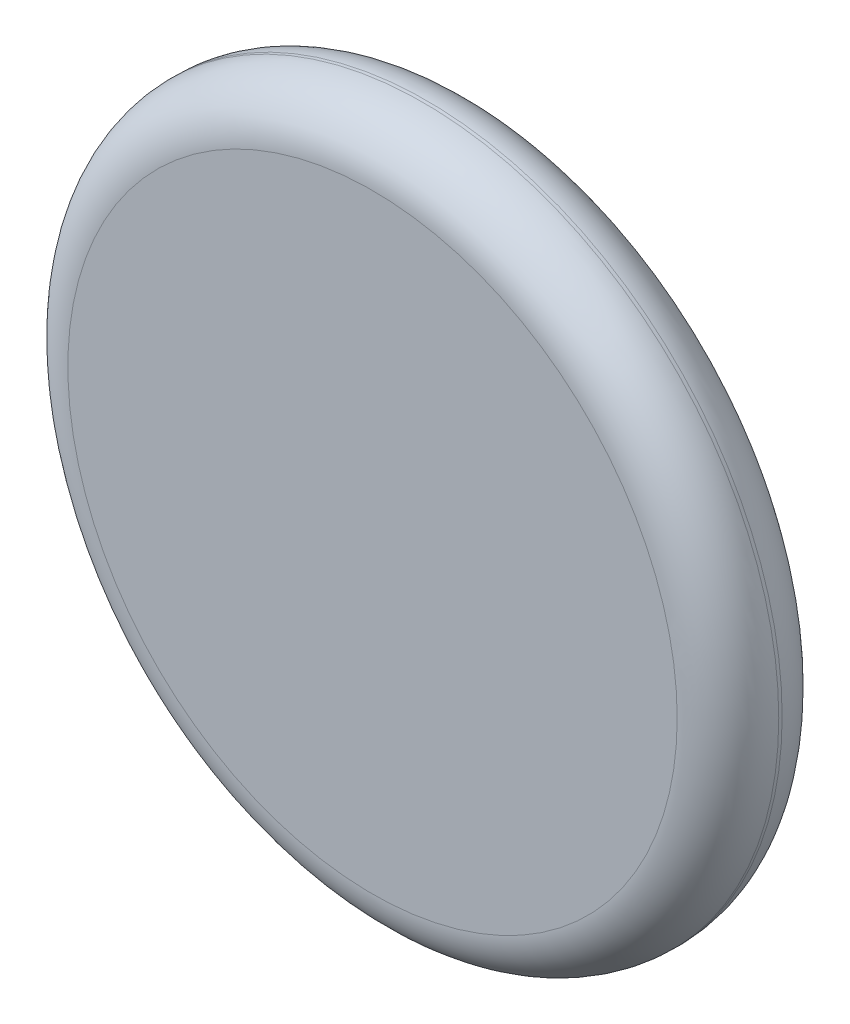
ISO-10303-21;
HEADER;
FILE_DESCRIPTION(('STEP AP214'),'2;1');
FILE_NAME('part.step','',(''),(''),'','','');
FILE_SCHEMA(('AUTOMOTIVE_DESIGN { 1 0 10303 214 1 1 1 1 }'));
ENDSEC;
DATA;
#1=APPLICATION_CONTEXT('core data for automotive mechanical design processes');
#2=APPLICATION_PROTOCOL_DEFINITION('international standard','automotive_design',2000,#1);
#3=PRODUCT_CONTEXT('',#1,'mechanical');
#4=PRODUCT('Part','Part','',(#3));
#5=PRODUCT_RELATED_PRODUCT_CATEGORY('part','',(#4));
#6=PRODUCT_DEFINITION_FORMATION('','',#4);
#7=PRODUCT_DEFINITION_CONTEXT('part definition',#1,'design');
#8=PRODUCT_DEFINITION('design','',#6,#7);
#9=PRODUCT_DEFINITION_SHAPE('','',#8);
#10=(LENGTH_UNIT() NAMED_UNIT(*) SI_UNIT(.MILLI.,.METRE.));
#11=(NAMED_UNIT(*) PLANE_ANGLE_UNIT() SI_UNIT($,.RADIAN.));
#12=(NAMED_UNIT(*) SI_UNIT($,.STERADIAN.) SOLID_ANGLE_UNIT());
#13=UNCERTAINTY_MEASURE_WITH_UNIT(LENGTH_MEASURE(1.E-05),#10,'distance_accuracy_value','');
#14=(GEOMETRIC_REPRESENTATION_CONTEXT(3) GLOBAL_UNCERTAINTY_ASSIGNED_CONTEXT((#13)) GLOBAL_UNIT_ASSIGNED_CONTEXT((#10,
#11,#12)) REPRESENTATION_CONTEXT('',''));
#15=CARTESIAN_POINT('',(0.,0.,0.));
#16=DIRECTION('',(0.,0.,1.));
#17=DIRECTION('',(1.,0.,0.));
#18=AXIS2_PLACEMENT_3D('',#15,#16,#17);
#19=CARTESIAN_POINT('',(0.,0.,6.2));
#20=DIRECTION('',(0.,0.,-1.));
#21=DIRECTION('',(-1.,0.,0.));
#22=AXIS2_PLACEMENT_3D('',#19,#20,#21);
#23=CYLINDRICAL_SURFACE('',#22,21.);
#24=CARTESIAN_POINT('',(0.,0.,3.));
#25=DIRECTION('',(0.,0.,1.));
#26=DIRECTION('',(1.,0.,0.));
#27=AXIS2_PLACEMENT_3D('',#24,#25,#26);
#28=CIRCLE('',#27,21.);
#29=CARTESIAN_POINT('',(-21.,0.,3.));
#30=VERTEX_POINT('',#29);
#31=EDGE_CURVE('E50',#30,#30,#28,.T.);
#32=CARTESIAN_POINT('',(0.,0.,3.2));
#33=DIRECTION('',(0.,0.,1.));
#34=DIRECTION('',(1.,0.,0.));
#35=AXIS2_PLACEMENT_3D('',#32,#33,#34);
#36=CIRCLE('',#35,21.);
#37=CARTESIAN_POINT('',(-21.,0.,3.2));
#38=VERTEX_POINT('',#37);
#39=EDGE_CURVE('E55',#38,#38,#36,.F.);
#40=CARTESIAN_POINT('',(-21.,0.,3.));
#41=CARTESIAN_POINT('',(-21.,0.,3.00208333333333));
#42=CARTESIAN_POINT('',(-21.,0.,3.00416666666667));
#43=CARTESIAN_POINT('',(-21.,0.,3.00833333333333));
#44=CARTESIAN_POINT('',(-21.,0.,3.01041666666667));
#45=CARTESIAN_POINT('',(-21.,0.,3.01458333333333));
#46=CARTESIAN_POINT('',(-21.,0.,3.01666666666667));
#47=CARTESIAN_POINT('',(-21.,0.,3.02083333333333));
#48=CARTESIAN_POINT('',(-21.,0.,3.02291666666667));
#49=CARTESIAN_POINT('',(-21.,0.,3.02708333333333));
#50=CARTESIAN_POINT('',(-21.,0.,3.02916666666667));
#51=CARTESIAN_POINT('',(-21.,0.,3.03333333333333));
#52=CARTESIAN_POINT('',(-21.,0.,3.03541666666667));
#53=CARTESIAN_POINT('',(-21.,0.,3.03958333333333));
#54=CARTESIAN_POINT('',(-21.,0.,3.04166666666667));
#55=CARTESIAN_POINT('',(-21.,0.,3.04583333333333));
#56=CARTESIAN_POINT('',(-21.,0.,3.04791666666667));
#57=CARTESIAN_POINT('',(-21.,0.,3.05208333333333));
#58=CARTESIAN_POINT('',(-21.,0.,3.05416666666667));
#59=CARTESIAN_POINT('',(-21.,0.,3.05833333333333));
#60=CARTESIAN_POINT('',(-21.,0.,3.06041666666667));
#61=CARTESIAN_POINT('',(-21.,0.,3.06458333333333));
#62=CARTESIAN_POINT('',(-21.,0.,3.06666666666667));
#63=CARTESIAN_POINT('',(-21.,0.,3.07083333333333));
#64=CARTESIAN_POINT('',(-21.,0.,3.07291666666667));
#65=CARTESIAN_POINT('',(-21.,0.,3.07708333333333));
#66=CARTESIAN_POINT('',(-21.,0.,3.07916666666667));
#67=CARTESIAN_POINT('',(-21.,0.,3.08333333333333));
#68=CARTESIAN_POINT('',(-21.,0.,3.08541666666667));
#69=CARTESIAN_POINT('',(-21.,0.,3.08958333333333));
#70=CARTESIAN_POINT('',(-21.,0.,3.09166666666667));
#71=CARTESIAN_POINT('',(-21.,0.,3.09583333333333));
#72=CARTESIAN_POINT('',(-21.,0.,3.09791666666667));
#73=CARTESIAN_POINT('',(-21.,0.,3.10208333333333));
#74=CARTESIAN_POINT('',(-21.,0.,3.10416666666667));
#75=CARTESIAN_POINT('',(-21.,0.,3.10833333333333));
#76=CARTESIAN_POINT('',(-21.,0.,3.11041666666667));
#77=CARTESIAN_POINT('',(-21.,0.,3.11458333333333));
#78=CARTESIAN_POINT('',(-21.,0.,3.11666666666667));
#79=CARTESIAN_POINT('',(-21.,0.,3.12083333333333));
#80=CARTESIAN_POINT('',(-21.,0.,3.12291666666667));
#81=CARTESIAN_POINT('',(-21.,0.,3.12708333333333));
#82=CARTESIAN_POINT('',(-21.,0.,3.12916666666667));
#83=CARTESIAN_POINT('',(-21.,0.,3.13333333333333));
#84=CARTESIAN_POINT('',(-21.,0.,3.13541666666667));
#85=CARTESIAN_POINT('',(-21.,0.,3.13958333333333));
#86=CARTESIAN_POINT('',(-21.,0.,3.14166666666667));
#87=CARTESIAN_POINT('',(-21.,0.,3.14583333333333));
#88=CARTESIAN_POINT('',(-21.,0.,3.14791666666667));
#89=CARTESIAN_POINT('',(-21.,0.,3.15208333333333));
#90=CARTESIAN_POINT('',(-21.,0.,3.15416666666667));
#91=CARTESIAN_POINT('',(-21.,0.,3.15833333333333));
#92=CARTESIAN_POINT('',(-21.,0.,3.16041666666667));
#93=CARTESIAN_POINT('',(-21.,0.,3.16458333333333));
#94=CARTESIAN_POINT('',(-21.,0.,3.16666666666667));
#95=CARTESIAN_POINT('',(-21.,0.,3.17083333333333));
#96=CARTESIAN_POINT('',(-21.,0.,3.17291666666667));
#97=CARTESIAN_POINT('',(-21.,0.,3.17708333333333));
#98=CARTESIAN_POINT('',(-21.,0.,3.17916666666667));
#99=CARTESIAN_POINT('',(-21.,0.,3.18333333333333));
#100=CARTESIAN_POINT('',(-21.,0.,3.18541666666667));
#101=CARTESIAN_POINT('',(-21.,0.,3.18958333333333));
#102=CARTESIAN_POINT('',(-21.,0.,3.19166666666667));
#103=CARTESIAN_POINT('',(-21.,0.,3.19583333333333));
#104=CARTESIAN_POINT('',(-21.,0.,3.19791666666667));
#105=CARTESIAN_POINT('',(-21.,0.,3.2));
#106=B_SPLINE_CURVE_WITH_KNOTS('',3,(#40,#41,#42,#43,#44,#45,#46,#47,#48,#49,#50,#51,#52,#53,
#54,#55,#56,#57,#58,#59,#60,#61,#62,#63,#64,#65,#66,#67,#68,#69,#70,#71,#72,#73,#74,#75,#76,#77,
#78,#79,#80,#81,#82,#83,#84,#85,#86,#87,#88,#89,#90,#91,#92,#93,#94,#95,#96,#97,#98,#99,#100,
#101,#102,#103,#104,#105),.UNSPECIFIED.,.F.,.F.,(4,2,2,2,2,2,2,2,2,2,2,2,2,2,2,2,2,2,2,2,2,2,2,
2,2,2,2,2,2,2,2,2,4),(0.,0.00625000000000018,0.0124999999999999,0.0187500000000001,
0.0249999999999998,0.03125,0.0374999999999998,0.04375,0.0499999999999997,0.0562499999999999,
0.0625000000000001,0.0687499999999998,0.075,0.0812499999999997,0.0874999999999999,
0.0937499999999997,0.0999999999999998,0.10625,0.1125,0.11875,0.125,0.13125,0.1375,0.14375,0.15,
0.15625,0.1625,0.16875,0.175,0.18125,0.1875,0.193749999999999,0.2),.UNSPECIFIED.);
#107=EDGE_CURVE('BSEAM37',#30,#38,#106,.T.);
#108=ORIENTED_EDGE('',*,*,#31,.T.);
#109=ORIENTED_EDGE('',*,*,#39,.T.);
#110=ORIENTED_EDGE('',*,*,#107,.T.);
#111=ORIENTED_EDGE('',*,*,#107,.F.);
#112=EDGE_LOOP('',(#108,#110,#109,#111));
#113=FACE_BOUND('',#112,.T.);
#114=ADVANCED_FACE('F37',(#113),#23,.T.);
#115=CARTESIAN_POINT('',(0.,0.,6.2));
#116=DIRECTION('',(0.,0.,1.));
#117=DIRECTION('',(1.,0.,0.));
#118=AXIS2_PLACEMENT_3D('',#115,#116,#117);
#119=PLANE('',#118);
#120=CARTESIAN_POINT('',(0.,0.,6.2));
#121=DIRECTION('',(0.,0.,1.));
#122=DIRECTION('',(1.,0.,0.));
#123=AXIS2_PLACEMENT_3D('',#120,#121,#122);
#124=CIRCLE('',#123,18.);
#125=CARTESIAN_POINT('',(18.,0.,6.2));
#126=VERTEX_POINT('',#125);
#127=EDGE_CURVE('E10',#126,#126,#124,.T.);
#128=ORIENTED_EDGE('',*,*,#127,.T.);
#129=EDGE_LOOP('',(#128));
#130=FACE_BOUND('',#129,.T.);
#131=ADVANCED_FACE('F81',(#130),#119,.T.);
#132=CARTESIAN_POINT('',(0.,0.,0.));
#133=DIRECTION('',(0.,0.,1.));
#134=DIRECTION('',(1.,0.,0.));
#135=AXIS2_PLACEMENT_3D('',#132,#133,#134);
#136=PLANE('',#135);
#137=CARTESIAN_POINT('',(0.,0.,0.));
#138=DIRECTION('',(0.,0.,-1.));
#139=DIRECTION('',(-1.,0.,0.));
#140=AXIS2_PLACEMENT_3D('',#137,#138,#139);
#141=CIRCLE('',#140,1.);
#142=CARTESIAN_POINT('',(-1.,0.,0.));
#143=VERTEX_POINT('',#142);
#144=EDGE_CURVE('E62',#143,#143,#141,.T.);
#145=ORIENTED_EDGE('',*,*,#144,.F.);
#146=EDGE_LOOP('',(#145));
#147=FACE_BOUND('',#146,.T.);
#148=CARTESIAN_POINT('',(0.,0.,0.));
#149=DIRECTION('',(0.,0.,1.));
#150=DIRECTION('',(1.,0.,0.));
#151=AXIS2_PLACEMENT_3D('',#148,#149,#150);
#152=CIRCLE('',#151,18.);
#153=CARTESIAN_POINT('',(18.,0.,0.));
#154=VERTEX_POINT('',#153);
#155=EDGE_CURVE('E45',#154,#154,#152,.F.);
#156=ORIENTED_EDGE('',*,*,#155,.T.);
#157=EDGE_LOOP('',(#156));
#158=FACE_BOUND('',#157,.T.);
#159=ADVANCED_FACE('F78',(#147,#158),#136,.F.);
#160=CARTESIAN_POINT('',(0.,0.,3.));
#161=DIRECTION('',(0.,0.,1.));
#162=DIRECTION('',(1.,0.,0.));
#163=AXIS2_PLACEMENT_3D('',#160,#161,#162);
#164=TOROIDAL_SURFACE('',#163,18.,3.);
#165=ORIENTED_EDGE('',*,*,#155,.F.);
#166=EDGE_LOOP('',(#165));
#167=FACE_BOUND('',#166,.T.);
#168=ORIENTED_EDGE('',*,*,#31,.F.);
#169=EDGE_LOOP('',(#168));
#170=FACE_BOUND('',#169,.T.);
#171=ADVANCED_FACE('F80',(#167,#170),#164,.T.);
#172=CARTESIAN_POINT('',(0.,0.,3.2));
#173=DIRECTION('',(0.,0.,1.));
#174=DIRECTION('',(1.,0.,0.));
#175=AXIS2_PLACEMENT_3D('',#172,#173,#174);
#176=TOROIDAL_SURFACE('',#175,18.,3.);
#177=ORIENTED_EDGE('',*,*,#39,.F.);
#178=EDGE_LOOP('',(#177));
#179=FACE_BOUND('',#178,.T.);
#180=ORIENTED_EDGE('',*,*,#127,.F.);
#181=EDGE_LOOP('',(#180));
#182=FACE_BOUND('',#181,.T.);
#183=ADVANCED_FACE('F39',(#179,#182),#176,.T.);
#184=CARTESIAN_POINT('',(0.,0.,2.));
#185=DIRECTION('',(0.,0.,-1.));
#186=DIRECTION('',(-1.,0.,0.));
#187=AXIS2_PLACEMENT_3D('',#184,#185,#186);
#188=CYLINDRICAL_SURFACE('',#187,1.);
#189=CARTESIAN_POINT('',(0.,0.,2.));
#190=DIRECTION('',(0.,0.,-1.));
#191=DIRECTION('',(-1.,0.,0.));
#192=AXIS2_PLACEMENT_3D('',#189,#190,#191);
#193=CIRCLE('',#192,1.);
#194=CARTESIAN_POINT('',(-1.,0.,2.));
#195=VERTEX_POINT('',#194);
#196=EDGE_CURVE('E61',#195,#195,#193,.T.);
#197=ORIENTED_EDGE('',*,*,#196,.F.);
#198=EDGE_LOOP('',(#197));
#199=FACE_BOUND('',#198,.T.);
#200=ORIENTED_EDGE('',*,*,#144,.T.);
#201=EDGE_LOOP('',(#200));
#202=FACE_BOUND('',#201,.T.);
#203=ADVANCED_FACE('F72',(#199,#202),#188,.F.);
#204=CARTESIAN_POINT('',(0.,0.,2.));
#205=DIRECTION('',(0.,0.,-1.));
#206=DIRECTION('',(-1.,0.,0.));
#207=AXIS2_PLACEMENT_3D('',#204,#205,#206);
#208=PLANE('',#207);
#209=ORIENTED_EDGE('',*,*,#196,.T.);
#210=EDGE_LOOP('',(#209));
#211=FACE_BOUND('',#210,.T.);
#212=ADVANCED_FACE('F70',(#211),#208,.T.);
#213=CLOSED_SHELL('',(#114,#131,#159,#171,#183,#203,#212));
#214=MANIFOLD_SOLID_BREP('B2',#213);
#215=ADVANCED_BREP_SHAPE_REPRESENTATION('',(#18,#214),#14);
#216=SHAPE_DEFINITION_REPRESENTATION(#9,#215);
ENDSEC;
END-ISO-10303-21;
